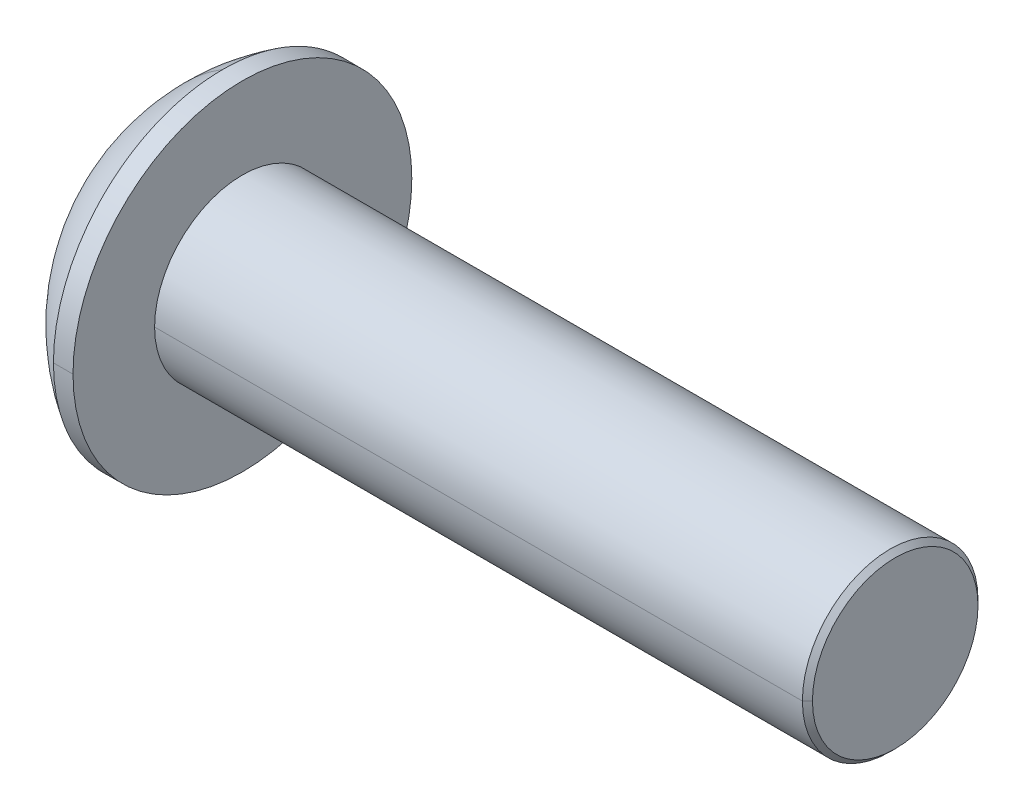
ISO-10303-21;
HEADER;
FILE_DESCRIPTION(('STEP AP214'),'2;1');
FILE_NAME('part.step','',(''),(''),'','','');
FILE_SCHEMA(('AUTOMOTIVE_DESIGN { 1 0 10303 214 1 1 1 1 }'));
ENDSEC;
DATA;
#1=APPLICATION_CONTEXT('core data for automotive mechanical design processes');
#2=APPLICATION_PROTOCOL_DEFINITION('international standard','automotive_design',2000,#1);
#3=PRODUCT_CONTEXT('',#1,'mechanical');
#4=PRODUCT('Part','Part','',(#3));
#5=PRODUCT_RELATED_PRODUCT_CATEGORY('part','',(#4));
#6=PRODUCT_DEFINITION_FORMATION('','',#4);
#7=PRODUCT_DEFINITION_CONTEXT('part definition',#1,'design');
#8=PRODUCT_DEFINITION('design','',#6,#7);
#9=PRODUCT_DEFINITION_SHAPE('','',#8);
#10=(LENGTH_UNIT() NAMED_UNIT(*) SI_UNIT(.MILLI.,.METRE.));
#11=(NAMED_UNIT(*) PLANE_ANGLE_UNIT() SI_UNIT($,.RADIAN.));
#12=(NAMED_UNIT(*) SI_UNIT($,.STERADIAN.) SOLID_ANGLE_UNIT());
#13=UNCERTAINTY_MEASURE_WITH_UNIT(LENGTH_MEASURE(1.E-05),#10,'distance_accuracy_value','');
#14=(GEOMETRIC_REPRESENTATION_CONTEXT(3) GLOBAL_UNCERTAINTY_ASSIGNED_CONTEXT((#13)) GLOBAL_UNIT_ASSIGNED_CONTEXT((#10,
#11,#12)) REPRESENTATION_CONTEXT('',''));
#15=CARTESIAN_POINT('',(0.,0.,0.));
#16=DIRECTION('',(0.,0.,1.));
#17=DIRECTION('',(1.,0.,0.));
#18=AXIS2_PLACEMENT_3D('',#15,#16,#17);
#19=CARTESIAN_POINT('',(1.32080000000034,0.,0.));
#20=DIRECTION('',(-1.,0.,0.));
#21=DIRECTION('',(0.,0.,1.));
#22=AXIS2_PLACEMENT_3D('',#19,#20,#21);
#23=CONICAL_SURFACE('',#22,1.1937999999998,1.04719755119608);
#24=DIRECTION('',(0.500000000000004,-2.16843878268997E-12,0.866025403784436));
#25=VECTOR('',#24,1.);
#26=CARTESIAN_POINT('',(-997.989959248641,4.33687756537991E-09,-1732.05080756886));
#27=LINE('',#26,#25);
#28=CARTESIAN_POINT('',(2.01004075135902,0.,4.44089209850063E-13));
#29=VERTEX_POINT('',#28);
#30=CARTESIAN_POINT('',(1.32080000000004,1.49457637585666E-12,-1.19380000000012));
#31=VERTEX_POINT('',#30);
#32=EDGE_CURVE('E116',#29,#31,#27,.F.);
#33=ORIENTED_EDGE('',*,*,#32,.T.);
#34=CARTESIAN_POINT('',(1.32080000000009,0.,0.));
#35=DIRECTION('',(-1.,0.,0.));
#36=DIRECTION('',(0.,0.,1.));
#37=AXIS2_PLACEMENT_3D('',#34,#35,#36);
#38=CIRCLE('',#37,1.19380000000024);
#39=CARTESIAN_POINT('',(1.32080000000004,-1.03386112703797,-0.59690000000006));
#40=VERTEX_POINT('',#39);
#41=EDGE_CURVE('E424',#31,#40,#38,.T.);
#42=ORIENTED_EDGE('',*,*,#41,.T.);
#43=CARTESIAN_POINT('',(1.32080000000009,0.,0.));
#44=DIRECTION('',(-1.,0.,0.));
#45=DIRECTION('',(0.,0.,1.));
#46=AXIS2_PLACEMENT_3D('',#43,#44,#45);
#47=CIRCLE('',#46,1.19380000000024);
#48=CARTESIAN_POINT('',(1.32080000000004,-1.03386112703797,0.59690000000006));
#49=VERTEX_POINT('',#48);
#50=EDGE_CURVE('E96',#40,#49,#47,.T.);
#51=ORIENTED_EDGE('',*,*,#50,.T.);
#52=CARTESIAN_POINT('',(1.32080000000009,0.,0.));
#53=DIRECTION('',(-1.,0.,0.));
#54=DIRECTION('',(0.,0.,1.));
#55=AXIS2_PLACEMENT_3D('',#52,#53,#54);
#56=CIRCLE('',#55,1.19380000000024);
#57=CARTESIAN_POINT('',(1.32080000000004,0.,1.19380000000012));
#58=VERTEX_POINT('',#57);
#59=EDGE_CURVE('E19',#49,#58,#56,.T.);
#60=ORIENTED_EDGE('',*,*,#59,.T.);
#61=DIRECTION('',(0.500000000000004,0.,-0.866025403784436));
#62=VECTOR('',#61,1.);
#63=CARTESIAN_POINT('',(-997.989959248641,0.,1732.05080756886));
#64=LINE('',#63,#62);
#65=EDGE_CURVE('E114',#58,#29,#64,.T.);
#66=ORIENTED_EDGE('',*,*,#65,.T.);
#67=EDGE_LOOP('',(#33,#42,#51,#60,#66));
#68=FACE_BOUND('',#67,.T.);
#69=ADVANCED_FACE('F16',(#68),#23,.F.);
#70=CARTESIAN_POINT('',(1.32080000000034,0.,0.));
#71=DIRECTION('',(-1.,0.,0.));
#72=DIRECTION('',(0.,0.,1.));
#73=AXIS2_PLACEMENT_3D('',#70,#71,#72);
#74=CONICAL_SURFACE('',#73,1.1937999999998,1.04719755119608);
#75=ORIENTED_EDGE('',*,*,#65,.F.);
#76=CARTESIAN_POINT('',(1.32080000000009,0.,0.));
#77=DIRECTION('',(-1.,0.,0.));
#78=DIRECTION('',(0.,0.,1.));
#79=AXIS2_PLACEMENT_3D('',#76,#77,#78);
#80=CIRCLE('',#79,1.19380000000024);
#81=CARTESIAN_POINT('',(1.32080000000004,1.03386112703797,0.596900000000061));
#82=VERTEX_POINT('',#81);
#83=EDGE_CURVE('E341',#58,#82,#80,.T.);
#84=ORIENTED_EDGE('',*,*,#83,.T.);
#85=CARTESIAN_POINT('',(1.32080000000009,0.,0.));
#86=DIRECTION('',(-1.,0.,0.));
#87=DIRECTION('',(0.,0.,1.));
#88=AXIS2_PLACEMENT_3D('',#85,#86,#87);
#89=CIRCLE('',#88,1.19380000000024);
#90=CARTESIAN_POINT('',(1.32080000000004,1.03386112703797,-0.596900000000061));
#91=VERTEX_POINT('',#90);
#92=EDGE_CURVE('E438',#82,#91,#89,.T.);
#93=ORIENTED_EDGE('',*,*,#92,.T.);
#94=CARTESIAN_POINT('',(1.32080000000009,0.,0.));
#95=DIRECTION('',(-1.,0.,0.));
#96=DIRECTION('',(0.,0.,1.));
#97=AXIS2_PLACEMENT_3D('',#94,#95,#96);
#98=CIRCLE('',#97,1.19380000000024);
#99=EDGE_CURVE('E123',#91,#31,#98,.T.);
#100=ORIENTED_EDGE('',*,*,#99,.T.);
#101=ORIENTED_EDGE('',*,*,#32,.F.);
#102=EDGE_LOOP('',(#75,#84,#93,#100,#101));
#103=FACE_BOUND('',#102,.T.);
#104=ADVANCED_FACE('F121',(#103),#74,.F.);
#105=CARTESIAN_POINT('',(1.3208,-2.06772225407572,-1.1938));
#106=DIRECTION('',(1.,0.,0.));
#107=DIRECTION('',(0.,0.,-1.));
#108=AXIS2_PLACEMENT_3D('',#105,#106,#107);
#109=PLANE('',#108);
#110=DIRECTION('',(0.,0.5,0.866025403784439));
#111=VECTOR('',#110,1.);
#112=CARTESIAN_POINT('',(1.3208,-1.37848150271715,0.));
#113=LINE('',#112,#111);
#114=CARTESIAN_POINT('',(1.3208,-0.689240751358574,1.1938));
#115=VERTEX_POINT('',#114);
#116=EDGE_CURVE('E105',#115,#49,#113,.F.);
#117=ORIENTED_EDGE('',*,*,#116,.F.);
#118=DIRECTION('',(0.,1.,0.));
#119=VECTOR('',#118,1.);
#120=CARTESIAN_POINT('',(1.3208,-0.689240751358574,1.1938));
#121=LINE('',#120,#119);
#122=EDGE_CURVE('E340',#58,#115,#121,.F.);
#123=ORIENTED_EDGE('',*,*,#122,.F.);
#124=ORIENTED_EDGE('',*,*,#59,.F.);
#125=EDGE_LOOP('',(#117,#123,#124));
#126=FACE_BOUND('',#125,.T.);
#127=ADVANCED_FACE('F230',(#126),#109,.F.);
#128=CARTESIAN_POINT('',(1.3208,-2.06772225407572,-1.1938));
#129=DIRECTION('',(1.,0.,0.));
#130=DIRECTION('',(0.,0.,-1.));
#131=AXIS2_PLACEMENT_3D('',#128,#129,#130);
#132=PLANE('',#131);
#133=DIRECTION('',(0.,-0.5,0.866025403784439));
#134=VECTOR('',#133,1.);
#135=CARTESIAN_POINT('',(1.3208,-0.689240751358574,-1.1938));
#136=LINE('',#135,#134);
#137=CARTESIAN_POINT('',(1.3208,-1.37848150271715,0.));
#138=VERTEX_POINT('',#137);
#139=EDGE_CURVE('E377',#138,#40,#136,.F.);
#140=ORIENTED_EDGE('',*,*,#139,.F.);
#141=DIRECTION('',(0.,0.5,0.866025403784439));
#142=VECTOR('',#141,1.);
#143=CARTESIAN_POINT('',(1.3208,-1.37848150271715,0.));
#144=LINE('',#143,#142);
#145=EDGE_CURVE('E389',#49,#138,#144,.F.);
#146=ORIENTED_EDGE('',*,*,#145,.F.);
#147=ORIENTED_EDGE('',*,*,#50,.F.);
#148=EDGE_LOOP('',(#140,#146,#147));
#149=FACE_BOUND('',#148,.T.);
#150=ADVANCED_FACE('F226',(#149),#132,.F.);
#151=CARTESIAN_POINT('',(1.3208,-2.06772225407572,-1.1938));
#152=DIRECTION('',(1.,0.,0.));
#153=DIRECTION('',(0.,0.,-1.));
#154=AXIS2_PLACEMENT_3D('',#151,#152,#153);
#155=PLANE('',#154);
#156=DIRECTION('',(0.,1.,0.));
#157=VECTOR('',#156,1.);
#158=CARTESIAN_POINT('',(1.3208,0.689240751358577,-1.1938));
#159=LINE('',#158,#157);
#160=CARTESIAN_POINT('',(1.3208,-0.689240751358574,-1.1938));
#161=VERTEX_POINT('',#160);
#162=EDGE_CURVE('E362',#161,#31,#159,.T.);
#163=ORIENTED_EDGE('',*,*,#162,.F.);
#164=DIRECTION('',(0.,-0.5,0.866025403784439));
#165=VECTOR('',#164,1.);
#166=CARTESIAN_POINT('',(1.3208,-0.689240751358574,-1.1938));
#167=LINE('',#166,#165);
#168=EDGE_CURVE('E374',#40,#161,#167,.F.);
#169=ORIENTED_EDGE('',*,*,#168,.F.);
#170=ORIENTED_EDGE('',*,*,#41,.F.);
#171=EDGE_LOOP('',(#163,#169,#170));
#172=FACE_BOUND('',#171,.T.);
#173=ADVANCED_FACE('F222',(#172),#155,.F.);
#174=CARTESIAN_POINT('',(1.3208,-2.06772225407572,-1.1938));
#175=DIRECTION('',(1.,0.,0.));
#176=DIRECTION('',(0.,0.,-1.));
#177=AXIS2_PLACEMENT_3D('',#174,#175,#176);
#178=PLANE('',#177);
#179=DIRECTION('',(0.,-0.5,-0.866025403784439));
#180=VECTOR('',#179,1.);
#181=CARTESIAN_POINT('',(1.3208,1.37848150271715,0.));
#182=LINE('',#181,#180);
#183=CARTESIAN_POINT('',(1.3208,0.689240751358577,-1.1938));
#184=VERTEX_POINT('',#183);
#185=EDGE_CURVE('E347',#184,#91,#182,.F.);
#186=ORIENTED_EDGE('',*,*,#185,.F.);
#187=DIRECTION('',(0.,1.,0.));
#188=VECTOR('',#187,1.);
#189=CARTESIAN_POINT('',(1.3208,0.689240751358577,-1.1938));
#190=LINE('',#189,#188);
#191=EDGE_CURVE('E359',#31,#184,#190,.T.);
#192=ORIENTED_EDGE('',*,*,#191,.F.);
#193=ORIENTED_EDGE('',*,*,#99,.F.);
#194=EDGE_LOOP('',(#186,#192,#193));
#195=FACE_BOUND('',#194,.T.);
#196=ADVANCED_FACE('F218',(#195),#178,.F.);
#197=CARTESIAN_POINT('',(1.3208,-2.06772225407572,-1.1938));
#198=DIRECTION('',(1.,0.,0.));
#199=DIRECTION('',(0.,0.,-1.));
#200=AXIS2_PLACEMENT_3D('',#197,#198,#199);
#201=PLANE('',#200);
#202=DIRECTION('',(0.,0.5,-0.866025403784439));
#203=VECTOR('',#202,1.);
#204=CARTESIAN_POINT('',(1.3208,0.689240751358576,1.1938));
#205=LINE('',#204,#203);
#206=CARTESIAN_POINT('',(1.3208,1.37848150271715,0.));
#207=VERTEX_POINT('',#206);
#208=EDGE_CURVE('E321',#207,#82,#205,.F.);
#209=ORIENTED_EDGE('',*,*,#208,.F.);
#210=DIRECTION('',(0.,-0.5,-0.866025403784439));
#211=VECTOR('',#210,1.);
#212=CARTESIAN_POINT('',(1.3208,1.37848150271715,0.));
#213=LINE('',#212,#211);
#214=EDGE_CURVE('E344',#91,#207,#213,.F.);
#215=ORIENTED_EDGE('',*,*,#214,.F.);
#216=ORIENTED_EDGE('',*,*,#92,.F.);
#217=EDGE_LOOP('',(#209,#215,#216));
#218=FACE_BOUND('',#217,.T.);
#219=ADVANCED_FACE('F214',(#218),#201,.F.);
#220=CARTESIAN_POINT('',(1.3208,-2.06772225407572,-1.1938));
#221=DIRECTION('',(1.,0.,0.));
#222=DIRECTION('',(0.,0.,-1.));
#223=AXIS2_PLACEMENT_3D('',#220,#221,#222);
#224=PLANE('',#223);
#225=DIRECTION('',(0.,1.,0.));
#226=VECTOR('',#225,1.);
#227=CARTESIAN_POINT('',(1.3208,-0.689240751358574,1.1938));
#228=LINE('',#227,#226);
#229=CARTESIAN_POINT('',(1.3208,0.689240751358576,1.1938));
#230=VERTEX_POINT('',#229);
#231=EDGE_CURVE('E337',#230,#58,#228,.F.);
#232=ORIENTED_EDGE('',*,*,#231,.F.);
#233=DIRECTION('',(0.,0.5,-0.866025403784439));
#234=VECTOR('',#233,1.);
#235=CARTESIAN_POINT('',(1.3208,0.689240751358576,1.1938));
#236=LINE('',#235,#234);
#237=EDGE_CURVE('E324',#82,#230,#236,.F.);
#238=ORIENTED_EDGE('',*,*,#237,.F.);
#239=ORIENTED_EDGE('',*,*,#83,.F.);
#240=EDGE_LOOP('',(#232,#238,#239));
#241=FACE_BOUND('',#240,.T.);
#242=ADVANCED_FACE('F210',(#241),#224,.F.);
#243=CARTESIAN_POINT('',(1.3208,-0.689240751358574,1.1938));
#244=DIRECTION('',(0.,0.,-1.));
#245=DIRECTION('',(0.,1.,0.));
#246=AXIS2_PLACEMENT_3D('',#243,#244,#245);
#247=PLANE('',#246);
#248=DIRECTION('',(0.,1.,0.));
#249=VECTOR('',#248,1.);
#250=CARTESIAN_POINT('',(0.,0.,1.1938));
#251=LINE('',#250,#249);
#252=CARTESIAN_POINT('',(0.,0.689240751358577,1.1938));
#253=VERTEX_POINT('',#252);
#254=CARTESIAN_POINT('',(0.,-0.689240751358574,1.1938));
#255=VERTEX_POINT('',#254);
#256=EDGE_CURVE('E317',#253,#255,#251,.F.);
#257=ORIENTED_EDGE('',*,*,#256,.F.);
#258=DIRECTION('',(1.,0.,0.));
#259=VECTOR('',#258,1.);
#260=CARTESIAN_POINT('',(1.3208,0.689240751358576,1.1938));
#261=LINE('',#260,#259);
#262=EDGE_CURVE('E330',#230,#253,#261,.F.);
#263=ORIENTED_EDGE('',*,*,#262,.F.);
#264=ORIENTED_EDGE('',*,*,#231,.T.);
#265=ORIENTED_EDGE('',*,*,#122,.T.);
#266=DIRECTION('',(1.,0.,0.));
#267=VECTOR('',#266,1.);
#268=CARTESIAN_POINT('',(1.3208,-0.689240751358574,1.1938));
#269=LINE('',#268,#267);
#270=EDGE_CURVE('E386',#255,#115,#269,.T.);
#271=ORIENTED_EDGE('',*,*,#270,.F.);
#272=EDGE_LOOP('',(#257,#263,#264,#265,#271));
#273=FACE_BOUND('',#272,.T.);
#274=ADVANCED_FACE('F206',(#273),#247,.T.);
#275=CARTESIAN_POINT('',(1.3208,-1.37848150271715,0.));
#276=DIRECTION('',(0.,0.866025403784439,-0.5));
#277=DIRECTION('',(0.,0.5,0.866025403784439));
#278=AXIS2_PLACEMENT_3D('',#275,#276,#277);
#279=PLANE('',#278);
#280=DIRECTION('',(0.,-0.5,-0.866025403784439));
#281=VECTOR('',#280,1.);
#282=CARTESIAN_POINT('',(0.,-0.689240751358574,1.1938));
#283=LINE('',#282,#281);
#284=CARTESIAN_POINT('',(0.,-1.37848150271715,0.));
#285=VERTEX_POINT('',#284);
#286=EDGE_CURVE('E314',#255,#285,#283,.T.);
#287=ORIENTED_EDGE('',*,*,#286,.F.);
#288=ORIENTED_EDGE('',*,*,#270,.T.);
#289=ORIENTED_EDGE('',*,*,#116,.T.);
#290=ORIENTED_EDGE('',*,*,#145,.T.);
#291=DIRECTION('',(1.,0.,0.));
#292=VECTOR('',#291,1.);
#293=CARTESIAN_POINT('',(1.3208,-1.37848150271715,0.));
#294=LINE('',#293,#292);
#295=EDGE_CURVE('E371',#285,#138,#294,.T.);
#296=ORIENTED_EDGE('',*,*,#295,.F.);
#297=EDGE_LOOP('',(#287,#288,#289,#290,#296));
#298=FACE_BOUND('',#297,.T.);
#299=ADVANCED_FACE('F202',(#298),#279,.T.);
#300=CARTESIAN_POINT('',(1.3208,-0.689240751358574,-1.1938));
#301=DIRECTION('',(0.,0.866025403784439,0.5));
#302=DIRECTION('',(0.,-0.5,0.866025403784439));
#303=AXIS2_PLACEMENT_3D('',#300,#301,#302);
#304=PLANE('',#303);
#305=DIRECTION('',(0.,0.5,-0.866025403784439));
#306=VECTOR('',#305,1.);
#307=CARTESIAN_POINT('',(0.,-1.37848150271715,0.));
#308=LINE('',#307,#306);
#309=CARTESIAN_POINT('',(0.,-0.689240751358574,-1.1938));
#310=VERTEX_POINT('',#309);
#311=EDGE_CURVE('E311',#285,#310,#308,.T.);
#312=ORIENTED_EDGE('',*,*,#311,.F.);
#313=ORIENTED_EDGE('',*,*,#295,.T.);
#314=ORIENTED_EDGE('',*,*,#139,.T.);
#315=ORIENTED_EDGE('',*,*,#168,.T.);
#316=DIRECTION('',(1.,0.,0.));
#317=VECTOR('',#316,1.);
#318=CARTESIAN_POINT('',(1.3208,-0.689240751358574,-1.1938));
#319=LINE('',#318,#317);
#320=EDGE_CURVE('E356',#310,#161,#319,.T.);
#321=ORIENTED_EDGE('',*,*,#320,.F.);
#322=EDGE_LOOP('',(#312,#313,#314,#315,#321));
#323=FACE_BOUND('',#322,.T.);
#324=ADVANCED_FACE('F198',(#323),#304,.T.);
#325=CARTESIAN_POINT('',(1.3208,0.689240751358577,-1.1938));
#326=DIRECTION('',(0.,0.,1.));
#327=DIRECTION('',(1.,0.,0.));
#328=AXIS2_PLACEMENT_3D('',#325,#326,#327);
#329=PLANE('',#328);
#330=DIRECTION('',(0.,1.,0.));
#331=VECTOR('',#330,1.);
#332=CARTESIAN_POINT('',(0.,0.,-1.1938));
#333=LINE('',#332,#331);
#334=CARTESIAN_POINT('',(0.,0.689240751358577,-1.1938));
#335=VERTEX_POINT('',#334);
#336=EDGE_CURVE('E308',#310,#335,#333,.T.);
#337=ORIENTED_EDGE('',*,*,#336,.F.);
#338=ORIENTED_EDGE('',*,*,#320,.T.);
#339=ORIENTED_EDGE('',*,*,#162,.T.);
#340=ORIENTED_EDGE('',*,*,#191,.T.);
#341=DIRECTION('',(1.,0.,0.));
#342=VECTOR('',#341,1.);
#343=CARTESIAN_POINT('',(1.3208,0.689240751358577,-1.1938));
#344=LINE('',#343,#342);
#345=EDGE_CURVE('E325',#335,#184,#344,.T.);
#346=ORIENTED_EDGE('',*,*,#345,.F.);
#347=EDGE_LOOP('',(#337,#338,#339,#340,#346));
#348=FACE_BOUND('',#347,.T.);
#349=ADVANCED_FACE('F194',(#348),#329,.T.);
#350=CARTESIAN_POINT('',(1.3208,1.37848150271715,0.));
#351=DIRECTION('',(0.,-0.866025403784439,0.5));
#352=DIRECTION('',(0.,-0.5,-0.866025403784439));
#353=AXIS2_PLACEMENT_3D('',#350,#351,#352);
#354=PLANE('',#353);
#355=DIRECTION('',(0.,0.5,0.866025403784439));
#356=VECTOR('',#355,1.);
#357=CARTESIAN_POINT('',(0.,0.689240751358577,-1.1938));
#358=LINE('',#357,#356);
#359=CARTESIAN_POINT('',(0.,1.37848150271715,0.));
#360=VERTEX_POINT('',#359);
#361=EDGE_CURVE('E305',#335,#360,#358,.T.);
#362=ORIENTED_EDGE('',*,*,#361,.F.);
#363=ORIENTED_EDGE('',*,*,#345,.T.);
#364=ORIENTED_EDGE('',*,*,#185,.T.);
#365=ORIENTED_EDGE('',*,*,#214,.T.);
#366=DIRECTION('',(1.,0.,0.));
#367=VECTOR('',#366,1.);
#368=CARTESIAN_POINT('',(1.3208,1.37848150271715,0.));
#369=LINE('',#368,#367);
#370=EDGE_CURVE('E320',#360,#207,#369,.T.);
#371=ORIENTED_EDGE('',*,*,#370,.F.);
#372=EDGE_LOOP('',(#362,#363,#364,#365,#371));
#373=FACE_BOUND('',#372,.T.);
#374=ADVANCED_FACE('F190',(#373),#354,.T.);
#375=CARTESIAN_POINT('',(1.3208,0.689240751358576,1.1938));
#376=DIRECTION('',(0.,-0.866025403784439,-0.5));
#377=DIRECTION('',(0.,0.5,-0.866025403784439));
#378=AXIS2_PLACEMENT_3D('',#375,#376,#377);
#379=PLANE('',#378);
#380=DIRECTION('',(0.,-0.5,0.866025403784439));
#381=VECTOR('',#380,1.);
#382=CARTESIAN_POINT('',(0.,1.37848150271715,0.));
#383=LINE('',#382,#381);
#384=EDGE_CURVE('E302',#360,#253,#383,.T.);
#385=ORIENTED_EDGE('',*,*,#384,.F.);
#386=ORIENTED_EDGE('',*,*,#370,.T.);
#387=ORIENTED_EDGE('',*,*,#208,.T.);
#388=ORIENTED_EDGE('',*,*,#237,.T.);
#389=ORIENTED_EDGE('',*,*,#262,.T.);
#390=EDGE_LOOP('',(#385,#386,#387,#388,#389));
#391=FACE_BOUND('',#390,.T.);
#392=ADVANCED_FACE('F183',(#391),#379,.T.);
#393=CARTESIAN_POINT('',(0.,0.,0.));
#394=DIRECTION('',(-1.,0.,0.));
#395=DIRECTION('',(0.,0.,1.));
#396=AXIS2_PLACEMENT_3D('',#393,#394,#395);
#397=PLANE('',#396);
#398=ORIENTED_EDGE('',*,*,#361,.T.);
#399=ORIENTED_EDGE('',*,*,#384,.T.);
#400=ORIENTED_EDGE('',*,*,#256,.T.);
#401=ORIENTED_EDGE('',*,*,#286,.T.);
#402=ORIENTED_EDGE('',*,*,#311,.T.);
#403=ORIENTED_EDGE('',*,*,#336,.T.);
#404=EDGE_LOOP('',(#398,#399,#400,#401,#402,#403));
#405=FACE_BOUND('',#404,.T.);
#406=CARTESIAN_POINT('',(0.,-1.647825,0.));
#407=CARTESIAN_POINT('',(0.,-1.64782546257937,-0.0463600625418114));
#408=CARTESIAN_POINT('',(0.,-1.64586761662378,-0.0926995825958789));
#409=CARTESIAN_POINT('',(0.,-1.63805794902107,-0.18504454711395));
#410=CARTESIAN_POINT('',(0.,-1.63220652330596,-0.231050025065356));
#411=CARTESIAN_POINT('',(1.3450905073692E-13,-1.60886968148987,-0.367996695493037));
#412=CARTESIAN_POINT('',(6.71146648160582E-13,-1.58560154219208,-0.458015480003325));
#413=CARTESIAN_POINT('',(7.11437313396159E-13,-1.52425445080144,-0.632903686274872));
#414=CARTESIAN_POINT('',(2.14610656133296E-13,-1.48616862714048,-0.717770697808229));
#415=CARTESIAN_POINT('',(-1.07003151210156E-13,-1.41883143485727,-0.839282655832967));
#416=CARTESIAN_POINT('',(-1.43584519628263E-13,-1.39468114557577,-0.878825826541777));
#417=CARTESIAN_POINT('',(1.44155593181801E-13,-1.34311659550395,-0.955778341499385));
#418=CARTESIAN_POINT('',(4.68821926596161E-13,-1.3156992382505,-0.993185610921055));
#419=CARTESIAN_POINT('',(8.15867817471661E-13,-1.2288892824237,-1.10169023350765));
#420=CARTESIAN_POINT('',(2.13706680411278E-13,-1.16488097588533,-1.16917450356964));
#421=CARTESIAN_POINT('',(-2.13273409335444E-13,-1.02643094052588,-1.29242274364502));
#422=CARTESIAN_POINT('',(0.,-0.951989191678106,-1.34818669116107));
#423=CARTESIAN_POINT('',(0.,-0.834157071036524,-1.42185247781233));
#424=CARTESIAN_POINT('',(0.,-0.793821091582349,-1.44475689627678));
#425=CARTESIAN_POINT('',(0.,-0.711405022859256,-1.48706903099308));
#426=CARTESIAN_POINT('',(0.,-0.669326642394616,-1.5064800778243));
#427=CARTESIAN_POINT('',(0.,-0.540835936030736,-1.55928933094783));
#428=CARTESIAN_POINT('',(0.,-0.452130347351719,-1.58728716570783));
#429=CARTESIAN_POINT('',(0.,-0.271321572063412,-1.62797740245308));
#430=CARTESIAN_POINT('',(0.,-0.179218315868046,-1.64066949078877));
#431=CARTESIAN_POINT('',(0.,0.00582546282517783,-1.65041602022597));
#432=CARTESIAN_POINT('',(0.,0.0987660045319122,-1.64747010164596));
#433=CARTESIAN_POINT('',(0.,0.282831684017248,-1.62601307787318));
#434=CARTESIAN_POINT('',(0.,0.373956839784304,-1.60750212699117));
#435=CARTESIAN_POINT('',(0.,0.551797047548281,-1.55545355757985));
#436=CARTESIAN_POINT('',(0.,0.638512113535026,-1.52191598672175));
#437=CARTESIAN_POINT('',(0.,0.805118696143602,-1.44072455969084));
#438=CARTESIAN_POINT('',(0.,0.885010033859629,-1.39307033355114));
#439=CARTESIAN_POINT('',(0.,0.997909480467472,-1.31211919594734));
#440=CARTESIAN_POINT('',(0.,1.03439227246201,-1.28355122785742));
#441=CARTESIAN_POINT('',(0.,1.10486154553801,-1.22341945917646));
#442=CARTESIAN_POINT('',(0.,1.13884558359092,-1.1918527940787));
#443=CARTESIAN_POINT('',(0.,1.23657300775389,-1.09305906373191));
#444=CARTESIAN_POINT('',(0.,1.29619287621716,-1.02166556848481));
#445=CARTESIAN_POINT('',(0.,1.40258051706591,-0.869876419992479));
#446=CARTESIAN_POINT('',(0.,1.44934877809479,-0.789481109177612));
#447=CARTESIAN_POINT('',(0.,1.5088880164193,-0.663883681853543));
#448=CARTESIAN_POINT('',(0.,1.52697883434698,-0.621136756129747));
#449=CARTESIAN_POINT('',(0.,1.55948234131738,-0.534313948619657));
#450=CARTESIAN_POINT('',(0.,1.57389800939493,-0.490239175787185));
#451=CARTESIAN_POINT('',(1.97397514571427E-13,1.61145082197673,-0.356501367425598));
#452=CARTESIAN_POINT('',(1.07342298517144E-12,1.62897460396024,-0.26515399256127));
#453=CARTESIAN_POINT('',(4.56717150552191E-13,1.64174643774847,-0.144362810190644));
#454=CARTESIAN_POINT('',(1.78018042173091E-13,1.64402699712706,-0.115512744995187));
#455=CARTESIAN_POINT('',(-1.77290428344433E-13,1.64706377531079,-0.057780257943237));
#456=CARTESIAN_POINT('',(-2.54233114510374E-13,1.6478225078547,-0.0288979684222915));
#457=CARTESIAN_POINT('',(0.,1.647825,0.));
#458=B_SPLINE_CURVE_WITH_KNOTS('',3,(#406,#407,#408,#409,#410,#411,#412,#413,#414,#415,#416,
#417,#418,#419,#420,#421,#422,#423,#424,#425,#426,#427,#428,#429,#430,#431,#432,#433,#434,#435,
#436,#437,#438,#439,#440,#441,#442,#443,#444,#445,#446,#447,#448,#449,#450,#451,#452,#453,#454,
#455,#456,#457),.UNSPECIFIED.,.F.,.F.,(4,2,2,2,2,2,2,2,2,2,2,2,2,2,2,2,2,2,2,2,2,2,2,2,2,4),(0.,
0.138998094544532,0.277982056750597,0.555513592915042,0.833173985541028,0.972034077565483,
1.11102684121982,1.38865970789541,1.66629310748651,1.80530427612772,1.94418220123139,
2.22180645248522,2.4994363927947,2.77707271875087,3.05470629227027,3.33233898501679,
3.60997895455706,3.74884861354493,3.88785228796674,4.16549070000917,4.44311855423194,
4.58222193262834,4.72121219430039,4.99863244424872,5.08542851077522,5.17208108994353),.UNSPECIFIED.);
#459=CARTESIAN_POINT('',(0.,-1.647825,0.));
#460=VERTEX_POINT('',#459);
#461=CARTESIAN_POINT('',(0.,1.647825,0.));
#462=VERTEX_POINT('',#461);
#463=EDGE_CURVE('E168',#460,#462,#458,.T.);
#464=ORIENTED_EDGE('',*,*,#463,.F.);
#465=CARTESIAN_POINT('',(0.,1.647825,0.));
#466=CARTESIAN_POINT('',(0.,1.64782546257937,0.0463600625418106));
#467=CARTESIAN_POINT('',(0.,1.64586761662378,0.0926995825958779));
#468=CARTESIAN_POINT('',(0.,1.63805794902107,0.185044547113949));
#469=CARTESIAN_POINT('',(0.,1.63220652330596,0.231050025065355));
#470=CARTESIAN_POINT('',(1.34677159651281E-13,1.60886968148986,0.367996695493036));
#471=CARTESIAN_POINT('',(6.71986392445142E-13,1.58560154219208,0.458015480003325));
#472=CARTESIAN_POINT('',(7.12332305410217E-13,1.52425445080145,0.632903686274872));
#473=CARTESIAN_POINT('',(2.1488866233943E-13,1.48616862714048,0.717770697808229));
#474=CARTESIAN_POINT('',(-1.07142184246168E-13,1.41883143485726,0.839282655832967));
#475=CARTESIAN_POINT('',(-1.43777804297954E-13,1.39468114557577,0.878825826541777));
#476=CARTESIAN_POINT('',(1.44349062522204E-13,1.34311659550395,0.955778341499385));
#477=CARTESIAN_POINT('',(4.6945687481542E-13,1.3156992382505,0.993185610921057));
#478=CARTESIAN_POINT('',(8.17199416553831E-13,1.22888928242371,1.10169023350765));
#479=CARTESIAN_POINT('',(2.14668375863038E-13,1.16488097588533,1.16917450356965));
#480=CARTESIAN_POINT('',(-2.14235106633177E-13,1.02643094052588,1.29242274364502));
#481=CARTESIAN_POINT('',(0.,0.951989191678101,1.34818669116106));
#482=CARTESIAN_POINT('',(0.,0.834157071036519,1.42185247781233));
#483=CARTESIAN_POINT('',(0.,0.793821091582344,1.44475689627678));
#484=CARTESIAN_POINT('',(0.,0.711405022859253,1.48706903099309));
#485=CARTESIAN_POINT('',(0.,0.669326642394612,1.5064800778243));
#486=CARTESIAN_POINT('',(0.,0.540835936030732,1.55928933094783));
#487=CARTESIAN_POINT('',(0.,0.452130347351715,1.58728716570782));
#488=CARTESIAN_POINT('',(0.,0.271321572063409,1.62797740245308));
#489=CARTESIAN_POINT('',(0.,0.179218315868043,1.64066949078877));
#490=CARTESIAN_POINT('',(0.,-0.00582546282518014,1.65041602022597));
#491=CARTESIAN_POINT('',(0.,-0.0987660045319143,1.64747010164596));
#492=CARTESIAN_POINT('',(0.,-0.28283168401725,1.62601307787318));
#493=CARTESIAN_POINT('',(0.,-0.373956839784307,1.60750212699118));
#494=CARTESIAN_POINT('',(0.,-0.551797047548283,1.55545355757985));
#495=CARTESIAN_POINT('',(0.,-0.638512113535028,1.52191598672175));
#496=CARTESIAN_POINT('',(0.,-0.805118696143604,1.44072455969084));
#497=CARTESIAN_POINT('',(0.,-0.885010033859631,1.39307033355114));
#498=CARTESIAN_POINT('',(0.,-0.997909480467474,1.31211919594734));
#499=CARTESIAN_POINT('',(0.,-1.03439227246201,1.28355122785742));
#500=CARTESIAN_POINT('',(0.,-1.10486154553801,1.22341945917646));
#501=CARTESIAN_POINT('',(0.,-1.13884558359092,1.1918527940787));
#502=CARTESIAN_POINT('',(0.,-1.23657300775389,1.09305906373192));
#503=CARTESIAN_POINT('',(0.,-1.29619287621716,1.02166556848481));
#504=CARTESIAN_POINT('',(0.,-1.40258051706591,0.869876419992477));
#505=CARTESIAN_POINT('',(0.,-1.44934877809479,0.789481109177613));
#506=CARTESIAN_POINT('',(0.,-1.50888801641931,0.663883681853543));
#507=CARTESIAN_POINT('',(0.,-1.52697883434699,0.621136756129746));
#508=CARTESIAN_POINT('',(0.,-1.55948234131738,0.534313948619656));
#509=CARTESIAN_POINT('',(0.,-1.57389800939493,0.490239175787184));
#510=CARTESIAN_POINT('',(1.97515783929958E-13,-1.61145082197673,0.356501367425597));
#511=CARTESIAN_POINT('',(1.07333137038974E-12,-1.62897460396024,0.265153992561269));
#512=CARTESIAN_POINT('',(4.5674581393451E-13,-1.64174643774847,0.144362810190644));
#513=CARTESIAN_POINT('',(1.78104881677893E-13,-1.64402699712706,0.115512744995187));
#514=CARTESIAN_POINT('',(-1.77377124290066E-13,-1.64706377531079,0.0577802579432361));
#515=CARTESIAN_POINT('',(-2.54551042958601E-13,-1.6478225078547,0.0288979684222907));
#516=CARTESIAN_POINT('',(0.,-1.647825,0.));
#517=B_SPLINE_CURVE_WITH_KNOTS('',3,(#465,#466,#467,#468,#469,#470,#471,#472,#473,#474,#475,
#476,#477,#478,#479,#480,#481,#482,#483,#484,#485,#486,#487,#488,#489,#490,#491,#492,#493,#494,
#495,#496,#497,#498,#499,#500,#501,#502,#503,#504,#505,#506,#507,#508,#509,#510,#511,#512,#513,
#514,#515,#516),.UNSPECIFIED.,.F.,.F.,(4,2,2,2,2,2,2,2,2,2,2,2,2,2,2,2,2,2,2,2,2,2,2,2,2,4),(0.,
0.138998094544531,0.277982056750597,0.555513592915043,0.833173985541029,0.972034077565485,
1.11102684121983,1.38865970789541,1.66629310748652,1.80530427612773,1.9441822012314,
2.22180645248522,2.4994363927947,2.77707271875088,3.05470629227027,3.33233898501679,
3.60997895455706,3.74884861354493,3.88785228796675,4.16549070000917,4.44311855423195,
4.58222193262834,4.72121219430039,4.99863244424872,5.08542851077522,5.17208108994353),.UNSPECIFIED.);
#518=EDGE_CURVE('E159',#462,#460,#517,.T.);
#519=ORIENTED_EDGE('',*,*,#518,.F.);
#520=EDGE_LOOP('',(#464,#519));
#521=FACE_BOUND('',#520,.T.);
#522=ADVANCED_FACE('F178',(#405,#521),#397,.T.);
#523=CARTESIAN_POINT('',(3.50132362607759,0.,0.));
#524=DIRECTION('',(0.,1.,0.));
#525=DIRECTION('',(1.,0.,0.));
#526=AXIS2_PLACEMENT_3D('',#523,#524,#525);
#527=SPHERICAL_SURFACE('',#526,3.86970210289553);
#528=ORIENTED_EDGE('',*,*,#463,.T.);
#529=CARTESIAN_POINT('',(3.50132362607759,0.,0.));
#530=DIRECTION('',(0.,0.,1.));
#531=DIRECTION('',(0.,1.,0.));
#532=AXIS2_PLACEMENT_3D('',#529,#530,#531);
#533=CIRCLE('',#532,3.86970210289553);
#534=CARTESIAN_POINT('',(1.4732,3.29565,0.));
#535=VERTEX_POINT('',#534);
#536=EDGE_CURVE('E167',#535,#462,#533,.T.);
#537=ORIENTED_EDGE('',*,*,#536,.F.);
#538=CARTESIAN_POINT('',(1.4732,0.,0.));
#539=DIRECTION('',(-1.,0.,0.));
#540=DIRECTION('',(0.,0.,1.));
#541=AXIS2_PLACEMENT_3D('',#538,#539,#540);
#542=CIRCLE('',#541,3.29565);
#543=CARTESIAN_POINT('',(1.4732,0.,-3.29565));
#544=VERTEX_POINT('',#543);
#545=EDGE_CURVE('E148',#544,#535,#542,.F.);
#546=ORIENTED_EDGE('',*,*,#545,.F.);
#547=CARTESIAN_POINT('',(1.4732,0.,0.));
#548=DIRECTION('',(-1.,0.,0.));
#549=DIRECTION('',(0.,0.,1.));
#550=AXIS2_PLACEMENT_3D('',#547,#548,#549);
#551=CIRCLE('',#550,3.29565);
#552=CARTESIAN_POINT('',(1.4732,-3.29565,0.));
#553=VERTEX_POINT('',#552);
#554=EDGE_CURVE('E152',#553,#544,#551,.F.);
#555=ORIENTED_EDGE('',*,*,#554,.F.);
#556=CARTESIAN_POINT('',(3.50132362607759,0.,0.));
#557=DIRECTION('',(0.,0.,1.));
#558=DIRECTION('',(0.,1.,0.));
#559=AXIS2_PLACEMENT_3D('',#556,#557,#558);
#560=CIRCLE('',#559,3.86970210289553);
#561=EDGE_CURVE('E299',#460,#553,#560,.T.);
#562=ORIENTED_EDGE('',*,*,#561,.F.);
#563=EDGE_LOOP('',(#528,#537,#546,#555,#562));
#564=FACE_BOUND('',#563,.T.);
#565=ADVANCED_FACE('F182',(#564),#527,.T.);
#566=CARTESIAN_POINT('',(3.50132362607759,0.,0.));
#567=DIRECTION('',(0.,1.,0.));
#568=DIRECTION('',(1.,0.,0.));
#569=AXIS2_PLACEMENT_3D('',#566,#567,#568);
#570=SPHERICAL_SURFACE('',#569,3.86970210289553);
#571=ORIENTED_EDGE('',*,*,#536,.T.);
#572=ORIENTED_EDGE('',*,*,#518,.T.);
#573=ORIENTED_EDGE('',*,*,#561,.T.);
#574=CARTESIAN_POINT('',(1.4732,0.,0.));
#575=DIRECTION('',(-1.,0.,0.));
#576=DIRECTION('',(0.,0.,1.));
#577=AXIS2_PLACEMENT_3D('',#574,#575,#576);
#578=CIRCLE('',#577,3.29565);
#579=CARTESIAN_POINT('',(1.4732,0.,3.29565));
#580=VERTEX_POINT('',#579);
#581=EDGE_CURVE('E154',#580,#553,#578,.F.);
#582=ORIENTED_EDGE('',*,*,#581,.F.);
#583=CARTESIAN_POINT('',(1.4732,0.,0.));
#584=DIRECTION('',(-1.,0.,0.));
#585=DIRECTION('',(0.,0.,1.));
#586=AXIS2_PLACEMENT_3D('',#583,#584,#585);
#587=CIRCLE('',#586,3.29565);
#588=EDGE_CURVE('E144',#535,#580,#587,.F.);
#589=ORIENTED_EDGE('',*,*,#588,.F.);
#590=EDGE_LOOP('',(#571,#572,#573,#582,#589));
#591=FACE_BOUND('',#590,.T.);
#592=ADVANCED_FACE('F174',(#591),#570,.T.);
#593=CARTESIAN_POINT('',(14.5542,0.,0.));
#594=DIRECTION('',(-1.,0.,0.));
#595=DIRECTION('',(0.,0.,1.));
#596=AXIS2_PLACEMENT_3D('',#593,#594,#595);
#597=PLANE('',#596);
#598=CARTESIAN_POINT('',(14.5542000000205,0.,0.));
#599=DIRECTION('',(-1.,0.,0.));
#600=DIRECTION('',(0.,0.,1.));
#601=AXIS2_PLACEMENT_3D('',#598,#599,#600);
#602=CIRCLE('',#601,1.61036000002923);
#603=CARTESIAN_POINT('',(14.5542000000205,0.,-1.61036000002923));
#604=VERTEX_POINT('',#603);
#605=CARTESIAN_POINT('',(14.5542000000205,0.,1.61036000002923));
#606=VERTEX_POINT('',#605);
#607=EDGE_CURVE('E139',#604,#606,#602,.T.);
#608=ORIENTED_EDGE('',*,*,#607,.F.);
#609=CARTESIAN_POINT('',(14.5542000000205,0.,0.));
#610=DIRECTION('',(-1.,0.,0.));
#611=DIRECTION('',(0.,0.,1.));
#612=AXIS2_PLACEMENT_3D('',#609,#610,#611);
#613=CIRCLE('',#612,1.61036000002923);
#614=EDGE_CURVE('E157',#606,#604,#613,.T.);
#615=ORIENTED_EDGE('',*,*,#614,.F.);
#616=EDGE_LOOP('',(#608,#615));
#617=FACE_BOUND('',#616,.T.);
#618=ADVANCED_FACE('F267',(#617),#597,.F.);
#619=CARTESIAN_POINT('',(14.4564100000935,0.,0.));
#620=DIRECTION('',(-1.,0.,0.));
#621=DIRECTION('',(0.,0.,1.));
#622=AXIS2_PLACEMENT_3D('',#619,#620,#621);
#623=CONICAL_SURFACE('',#622,1.70814999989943,0.785398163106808);
#624=CARTESIAN_POINT('',(14.45641,0.,0.));
#625=DIRECTION('',(-1.,0.,0.));
#626=DIRECTION('',(0.,0.,1.));
#627=AXIS2_PLACEMENT_3D('',#624,#625,#626);
#628=CIRCLE('',#627,1.70815);
#629=CARTESIAN_POINT('',(14.4564100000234,0.,1.70814999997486));
#630=VERTEX_POINT('',#629);
#631=CARTESIAN_POINT('',(14.4564100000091,0.,-1.70815000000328));
#632=VERTEX_POINT('',#631);
#633=EDGE_CURVE('E138',#630,#632,#628,.T.);
#634=ORIENTED_EDGE('',*,*,#633,.F.);
#635=DIRECTION('',(0.707106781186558,0.,-0.707106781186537));
#636=VECTOR('',#635,1.);
#637=CARTESIAN_POINT('',(-498983.835440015,0.,499000.));
#638=LINE('',#637,#636);
#639=EDGE_CURVE('E142',#606,#630,#638,.F.);
#640=ORIENTED_EDGE('',*,*,#639,.F.);
#641=ORIENTED_EDGE('',*,*,#614,.T.);
#642=DIRECTION('',(0.707106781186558,0.,0.707106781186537));
#643=VECTOR('',#642,1.);
#644=CARTESIAN_POINT('',(-498983.835440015,6.11098752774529E-11,-499000.));
#645=LINE('',#644,#643);
#646=EDGE_CURVE('E143',#632,#604,#645,.T.);
#647=ORIENTED_EDGE('',*,*,#646,.F.);
#648=EDGE_LOOP('',(#634,#640,#641,#647));
#649=FACE_BOUND('',#648,.T.);
#650=ADVANCED_FACE('F264',(#649),#623,.T.);
#651=CARTESIAN_POINT('',(0.,0.,0.));
#652=DIRECTION('',(-1.,0.,0.));
#653=DIRECTION('',(0.,0.,1.));
#654=AXIS2_PLACEMENT_3D('',#651,#652,#653);
#655=CYLINDRICAL_SURFACE('',#654,3.29565);
#656=ORIENTED_EDGE('',*,*,#581,.T.);
#657=ORIENTED_EDGE('',*,*,#554,.T.);
#658=DIRECTION('',(-1.,0.,0.));
#659=VECTOR('',#658,1.);
#660=CARTESIAN_POINT('',(0.,0.,-3.29565));
#661=LINE('',#660,#659);
#662=CARTESIAN_POINT('',(1.8542,0.,-3.29565));
#663=VERTEX_POINT('',#662);
#664=EDGE_CURVE('E151',#663,#544,#661,.T.);
#665=ORIENTED_EDGE('',*,*,#664,.F.);
#666=CARTESIAN_POINT('',(1.8542,0.,0.));
#667=DIRECTION('',(-1.,0.,0.));
#668=DIRECTION('',(0.,0.,1.));
#669=AXIS2_PLACEMENT_3D('',#666,#667,#668);
#670=CIRCLE('',#669,3.29565);
#671=CARTESIAN_POINT('',(1.8542,0.,3.29565));
#672=VERTEX_POINT('',#671);
#673=EDGE_CURVE('E136',#663,#672,#670,.T.);
#674=ORIENTED_EDGE('',*,*,#673,.T.);
#675=DIRECTION('',(-1.,0.,0.));
#676=VECTOR('',#675,1.);
#677=CARTESIAN_POINT('',(0.,0.,3.29565));
#678=LINE('',#677,#676);
#679=EDGE_CURVE('E147',#580,#672,#678,.F.);
#680=ORIENTED_EDGE('',*,*,#679,.F.);
#681=EDGE_LOOP('',(#656,#657,#665,#674,#680));
#682=FACE_BOUND('',#681,.T.);
#683=ADVANCED_FACE('F260',(#682),#655,.T.);
#684=CARTESIAN_POINT('',(0.,0.,0.));
#685=DIRECTION('',(-1.,0.,0.));
#686=DIRECTION('',(0.,0.,1.));
#687=AXIS2_PLACEMENT_3D('',#684,#685,#686);
#688=CYLINDRICAL_SURFACE('',#687,3.29565);
#689=ORIENTED_EDGE('',*,*,#588,.T.);
#690=ORIENTED_EDGE('',*,*,#679,.T.);
#691=CARTESIAN_POINT('',(1.8542,0.,0.));
#692=DIRECTION('',(-1.,0.,0.));
#693=DIRECTION('',(0.,0.,1.));
#694=AXIS2_PLACEMENT_3D('',#691,#692,#693);
#695=CIRCLE('',#694,3.29565);
#696=EDGE_CURVE('E133',#672,#663,#695,.T.);
#697=ORIENTED_EDGE('',*,*,#696,.T.);
#698=ORIENTED_EDGE('',*,*,#664,.T.);
#699=ORIENTED_EDGE('',*,*,#545,.T.);
#700=EDGE_LOOP('',(#689,#690,#697,#698,#699));
#701=FACE_BOUND('',#700,.T.);
#702=ADVANCED_FACE('F256',(#701),#688,.T.);
#703=CARTESIAN_POINT('',(14.4564100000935,0.,0.));
#704=DIRECTION('',(-1.,0.,0.));
#705=DIRECTION('',(0.,0.,1.));
#706=AXIS2_PLACEMENT_3D('',#703,#704,#705);
#707=CONICAL_SURFACE('',#706,1.70814999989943,0.785398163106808);
#708=ORIENTED_EDGE('',*,*,#639,.T.);
#709=CARTESIAN_POINT('',(14.45641,0.,0.));
#710=DIRECTION('',(-1.,0.,0.));
#711=DIRECTION('',(0.,0.,1.));
#712=AXIS2_PLACEMENT_3D('',#709,#710,#711);
#713=CIRCLE('',#712,1.70815);
#714=EDGE_CURVE('E282',#632,#630,#713,.T.);
#715=ORIENTED_EDGE('',*,*,#714,.F.);
#716=ORIENTED_EDGE('',*,*,#646,.T.);
#717=ORIENTED_EDGE('',*,*,#607,.T.);
#718=EDGE_LOOP('',(#708,#715,#716,#717));
#719=FACE_BOUND('',#718,.T.);
#720=ADVANCED_FACE('F253',(#719),#707,.T.);
#721=CARTESIAN_POINT('',(0.,0.,0.));
#722=DIRECTION('',(-1.,0.,0.));
#723=DIRECTION('',(0.,0.,1.));
#724=AXIS2_PLACEMENT_3D('',#721,#722,#723);
#725=CYLINDRICAL_SURFACE('',#724,1.70815);
#726=CARTESIAN_POINT('',(1.8542,0.,0.));
#727=DIRECTION('',(-1.,0.,0.));
#728=DIRECTION('',(0.,0.,1.));
#729=AXIS2_PLACEMENT_3D('',#726,#727,#728);
#730=CIRCLE('',#729,1.70815);
#731=CARTESIAN_POINT('',(1.8542,0.,-1.70815));
#732=VERTEX_POINT('',#731);
#733=CARTESIAN_POINT('',(1.8542,0.,1.70815));
#734=VERTEX_POINT('',#733);
#735=EDGE_CURVE('E34',#732,#734,#730,.F.);
#736=ORIENTED_EDGE('',*,*,#735,.T.);
#737=DIRECTION('',(-1.,0.,0.));
#738=VECTOR('',#737,1.);
#739=CARTESIAN_POINT('',(0.,0.,1.70815));
#740=LINE('',#739,#738);
#741=EDGE_CURVE('E25',#630,#734,#740,.T.);
#742=ORIENTED_EDGE('',*,*,#741,.F.);
#743=ORIENTED_EDGE('',*,*,#633,.T.);
#744=DIRECTION('',(-1.,0.,0.));
#745=VECTOR('',#744,1.);
#746=CARTESIAN_POINT('',(0.,0.,-1.70815));
#747=LINE('',#746,#745);
#748=EDGE_CURVE('E132',#732,#632,#747,.F.);
#749=ORIENTED_EDGE('',*,*,#748,.F.);
#750=EDGE_LOOP('',(#736,#742,#743,#749));
#751=FACE_BOUND('',#750,.T.);
#752=ADVANCED_FACE('F246',(#751),#725,.T.);
#753=CARTESIAN_POINT('',(1.8542,1.70815,0.));
#754=DIRECTION('',(-1.,0.,0.));
#755=DIRECTION('',(0.,0.,1.));
#756=AXIS2_PLACEMENT_3D('',#753,#754,#755);
#757=PLANE('',#756);
#758=CARTESIAN_POINT('',(1.8542,0.,0.));
#759=DIRECTION('',(-1.,0.,0.));
#760=DIRECTION('',(0.,0.,1.));
#761=AXIS2_PLACEMENT_3D('',#758,#759,#760);
#762=CIRCLE('',#761,1.70815);
#763=EDGE_CURVE('E11',#734,#732,#762,.F.);
#764=ORIENTED_EDGE('',*,*,#763,.F.);
#765=ORIENTED_EDGE('',*,*,#735,.F.);
#766=EDGE_LOOP('',(#764,#765));
#767=FACE_BOUND('',#766,.T.);
#768=ORIENTED_EDGE('',*,*,#673,.F.);
#769=ORIENTED_EDGE('',*,*,#696,.F.);
#770=EDGE_LOOP('',(#768,#769));
#771=FACE_BOUND('',#770,.T.);
#772=ADVANCED_FACE('F240',(#767,#771),#757,.F.);
#773=CARTESIAN_POINT('',(0.,0.,0.));
#774=DIRECTION('',(-1.,0.,0.));
#775=DIRECTION('',(0.,0.,1.));
#776=AXIS2_PLACEMENT_3D('',#773,#774,#775);
#777=CYLINDRICAL_SURFACE('',#776,1.70815);
#778=ORIENTED_EDGE('',*,*,#741,.T.);
#779=ORIENTED_EDGE('',*,*,#763,.T.);
#780=ORIENTED_EDGE('',*,*,#748,.T.);
#781=ORIENTED_EDGE('',*,*,#714,.T.);
#782=EDGE_LOOP('',(#778,#779,#780,#781));
#783=FACE_BOUND('',#782,.T.);
#784=ADVANCED_FACE('F238',(#783),#777,.T.);
#785=CLOSED_SHELL('',(#69,#104,#127,#150,#173,#196,#219,#242,#274,#299,#324,#349,#374,#392,#522,
#565,#592,#618,#650,#683,#702,#720,#752,#772,#784));
#786=MANIFOLD_SOLID_BREP('B1',#785);
#787=ADVANCED_BREP_SHAPE_REPRESENTATION('',(#18,#786),#14);
#788=SHAPE_DEFINITION_REPRESENTATION(#9,#787);
ENDSEC;
END-ISO-10303-21;
